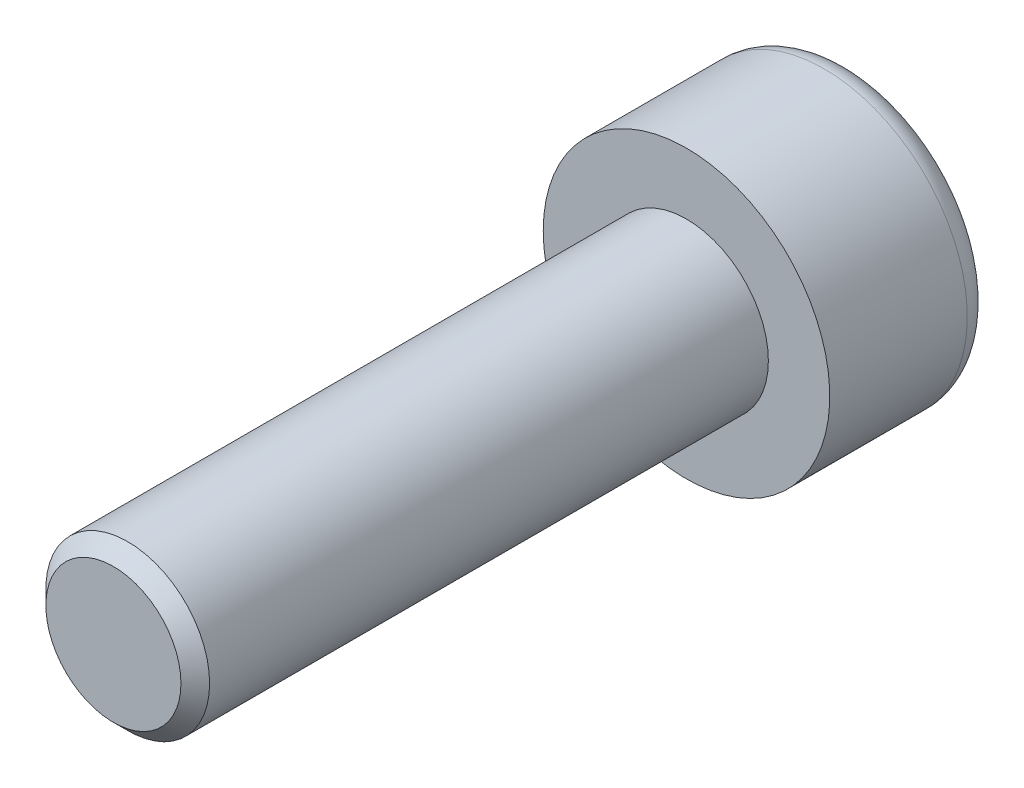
ISO-10303-21;
HEADER;
FILE_DESCRIPTION(('STEP AP214'),'2;1');
FILE_NAME('part.step','',(''),(''),'','','');
FILE_SCHEMA(('AUTOMOTIVE_DESIGN { 1 0 10303 214 1 1 1 1 }'));
ENDSEC;
DATA;
#1=APPLICATION_CONTEXT('core data for automotive mechanical design processes');
#2=APPLICATION_PROTOCOL_DEFINITION('international standard','automotive_design',2000,#1);
#3=PRODUCT_CONTEXT('',#1,'mechanical');
#4=PRODUCT('Part','Part','',(#3));
#5=PRODUCT_RELATED_PRODUCT_CATEGORY('part','',(#4));
#6=PRODUCT_DEFINITION_FORMATION('','',#4);
#7=PRODUCT_DEFINITION_CONTEXT('part definition',#1,'design');
#8=PRODUCT_DEFINITION('design','',#6,#7);
#9=PRODUCT_DEFINITION_SHAPE('','',#8);
#10=(LENGTH_UNIT() NAMED_UNIT(*) SI_UNIT(.MILLI.,.METRE.));
#11=(NAMED_UNIT(*) PLANE_ANGLE_UNIT() SI_UNIT($,.RADIAN.));
#12=(NAMED_UNIT(*) SI_UNIT($,.STERADIAN.) SOLID_ANGLE_UNIT());
#13=UNCERTAINTY_MEASURE_WITH_UNIT(LENGTH_MEASURE(1.E-05),#10,'distance_accuracy_value','');
#14=(GEOMETRIC_REPRESENTATION_CONTEXT(3) GLOBAL_UNCERTAINTY_ASSIGNED_CONTEXT((#13)) GLOBAL_UNIT_ASSIGNED_CONTEXT((#10,
#11,#12)) REPRESENTATION_CONTEXT('',''));
#15=CARTESIAN_POINT('',(0.,0.,0.));
#16=DIRECTION('',(0.,0.,1.));
#17=DIRECTION('',(1.,0.,0.));
#18=AXIS2_PLACEMENT_3D('',#15,#16,#17);
#19=CARTESIAN_POINT('',(0.,0.,-4.));
#20=DIRECTION('',(0.,0.,1.));
#21=DIRECTION('',(1.,0.,0.));
#22=AXIS2_PLACEMENT_3D('',#19,#20,#21);
#23=PLANE('',#22);
#24=CARTESIAN_POINT('',(0.,0.,-4.));
#25=DIRECTION('',(0.,0.,-1.));
#26=DIRECTION('',(-1.,0.,0.));
#27=AXIS2_PLACEMENT_3D('',#24,#25,#26);
#28=CIRCLE('',#27,2.86);
#29=CARTESIAN_POINT('',(-2.86,0.,-4.));
#30=VERTEX_POINT('',#29);
#31=EDGE_CURVE('E141',#30,#30,#28,.T.);
#32=ORIENTED_EDGE('',*,*,#31,.T.);
#33=EDGE_LOOP('',(#32));
#34=FACE_BOUND('',#33,.T.);
#35=DIRECTION('',(-0.86602540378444,0.499999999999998,0.));
#36=VECTOR('',#35,1.);
#37=CARTESIAN_POINT('',(0.,1.73205080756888,-4.));
#38=LINE('',#37,#36);
#39=CARTESIAN_POINT('',(1.5,0.866025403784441,-4.));
#40=VERTEX_POINT('',#39);
#41=CARTESIAN_POINT('',(0.,1.73205080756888,-4.));
#42=VERTEX_POINT('',#41);
#43=EDGE_CURVE('E45',#40,#42,#38,.T.);
#44=ORIENTED_EDGE('',*,*,#43,.T.);
#45=DIRECTION('',(-0.866025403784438,-0.500000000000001,0.));
#46=VECTOR('',#45,1.);
#47=CARTESIAN_POINT('',(0.,1.73205080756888,-4.));
#48=LINE('',#47,#46);
#49=CARTESIAN_POINT('',(-1.5,0.866025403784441,-4.));
#50=VERTEX_POINT('',#49);
#51=EDGE_CURVE('E85',#42,#50,#48,.T.);
#52=ORIENTED_EDGE('',*,*,#51,.T.);
#53=DIRECTION('',(0.,-1.,0.));
#54=VECTOR('',#53,1.);
#55=CARTESIAN_POINT('',(-1.5,-0.866025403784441,-4.));
#56=LINE('',#55,#54);
#57=CARTESIAN_POINT('',(-1.5,-0.866025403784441,-4.));
#58=VERTEX_POINT('',#57);
#59=EDGE_CURVE('E93',#50,#58,#56,.T.);
#60=ORIENTED_EDGE('',*,*,#59,.T.);
#61=DIRECTION('',(0.866025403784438,-0.500000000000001,0.));
#62=VECTOR('',#61,1.);
#63=CARTESIAN_POINT('',(0.,-1.73205080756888,-4.));
#64=LINE('',#63,#62);
#65=CARTESIAN_POINT('',(0.,-1.73205080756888,-4.));
#66=VERTEX_POINT('',#65);
#67=EDGE_CURVE('E111',#58,#66,#64,.T.);
#68=ORIENTED_EDGE('',*,*,#67,.T.);
#69=DIRECTION('',(0.86602540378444,0.499999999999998,0.));
#70=VECTOR('',#69,1.);
#71=CARTESIAN_POINT('',(0.,-1.73205080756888,-4.));
#72=LINE('',#71,#70);
#73=CARTESIAN_POINT('',(1.5,-0.866025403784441,-4.));
#74=VERTEX_POINT('',#73);
#75=EDGE_CURVE('E114',#66,#74,#72,.T.);
#76=ORIENTED_EDGE('',*,*,#75,.T.);
#77=DIRECTION('',(0.,1.,0.));
#78=VECTOR('',#77,1.);
#79=CARTESIAN_POINT('',(1.5,-0.866025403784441,-4.));
#80=LINE('',#79,#78);
#81=EDGE_CURVE('E104',#74,#40,#80,.T.);
#82=ORIENTED_EDGE('',*,*,#81,.T.);
#83=EDGE_LOOP('',(#44,#52,#60,#68,#76,#82));
#84=FACE_BOUND('',#83,.T.);
#85=ADVANCED_FACE('F31',(#34,#84),#23,.F.);
#86=CARTESIAN_POINT('',(0.,0.,-3.36));
#87=DIRECTION('',(0.,0.,-1.));
#88=DIRECTION('',(-1.,0.,0.));
#89=AXIS2_PLACEMENT_3D('',#86,#87,#88);
#90=TOROIDAL_SURFACE('',#89,2.86,0.64);
#91=ORIENTED_EDGE('',*,*,#31,.F.);
#92=EDGE_LOOP('',(#91));
#93=FACE_BOUND('',#92,.T.);
#94=CARTESIAN_POINT('',(0.,0.,-3.36));
#95=DIRECTION('',(0.,0.,-1.));
#96=DIRECTION('',(-1.,0.,0.));
#97=AXIS2_PLACEMENT_3D('',#94,#95,#96);
#98=CIRCLE('',#97,3.5);
#99=CARTESIAN_POINT('',(-3.5,0.,-3.36));
#100=VERTEX_POINT('',#99);
#101=EDGE_CURVE('E138',#100,#100,#98,.T.);
#102=ORIENTED_EDGE('',*,*,#101,.T.);
#103=EDGE_LOOP('',(#102));
#104=FACE_BOUND('',#103,.T.);
#105=ADVANCED_FACE('F160',(#93,#104),#90,.T.);
#106=CARTESIAN_POINT('',(0.,0.,0.));
#107=DIRECTION('',(0.,0.,-1.));
#108=DIRECTION('',(-1.,0.,0.));
#109=AXIS2_PLACEMENT_3D('',#106,#107,#108);
#110=CYLINDRICAL_SURFACE('',#109,3.5);
#111=ORIENTED_EDGE('',*,*,#101,.F.);
#112=EDGE_LOOP('',(#111));
#113=FACE_BOUND('',#112,.T.);
#114=CARTESIAN_POINT('',(0.,0.,0.));
#115=DIRECTION('',(0.,0.,-1.));
#116=DIRECTION('',(-1.,0.,0.));
#117=AXIS2_PLACEMENT_3D('',#114,#115,#116);
#118=CIRCLE('',#117,3.5);
#119=CARTESIAN_POINT('',(-3.5,0.,0.));
#120=VERTEX_POINT('',#119);
#121=EDGE_CURVE('E99',#120,#120,#118,.T.);
#122=ORIENTED_EDGE('',*,*,#121,.T.);
#123=EDGE_LOOP('',(#122));
#124=FACE_BOUND('',#123,.T.);
#125=ADVANCED_FACE('F165',(#113,#124),#110,.T.);
#126=CARTESIAN_POINT('',(0.,0.,0.));
#127=DIRECTION('',(0.,0.,-1.));
#128=DIRECTION('',(-1.,0.,0.));
#129=AXIS2_PLACEMENT_3D('',#126,#127,#128);
#130=PLANE('',#129);
#131=CARTESIAN_POINT('',(0.,0.,0.));
#132=DIRECTION('',(0.,0.,1.));
#133=DIRECTION('',(1.,0.,0.));
#134=AXIS2_PLACEMENT_3D('',#131,#132,#133);
#135=CIRCLE('',#134,2.);
#136=CARTESIAN_POINT('',(2.,0.,0.));
#137=VERTEX_POINT('',#136);
#138=EDGE_CURVE('E105',#137,#137,#135,.T.);
#139=ORIENTED_EDGE('',*,*,#138,.F.);
#140=EDGE_LOOP('',(#139));
#141=FACE_BOUND('',#140,.T.);
#142=ORIENTED_EDGE('',*,*,#121,.F.);
#143=EDGE_LOOP('',(#142));
#144=FACE_BOUND('',#143,.T.);
#145=ADVANCED_FACE('F173',(#141,#144),#130,.F.);
#146=CARTESIAN_POINT('',(0.,1.73205080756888,-2.));
#147=DIRECTION('',(-0.499999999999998,-0.86602540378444,0.));
#148=DIRECTION('',(0.86602540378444,-0.499999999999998,0.));
#149=AXIS2_PLACEMENT_3D('',#146,#147,#148);
#150=PLANE('',#149);
#151=ORIENTED_EDGE('',*,*,#43,.F.);
#152=DIRECTION('',(0.,0.,-1.));
#153=VECTOR('',#152,1.);
#154=CARTESIAN_POINT('',(1.5,0.866025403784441,-2.));
#155=LINE('',#154,#153);
#156=CARTESIAN_POINT('',(1.5,0.866025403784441,-2.));
#157=VERTEX_POINT('',#156);
#158=EDGE_CURVE('E127',#157,#40,#155,.T.);
#159=ORIENTED_EDGE('',*,*,#158,.F.);
#160=DIRECTION('',(-0.86602540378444,0.499999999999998,0.));
#161=VECTOR('',#160,1.);
#162=CARTESIAN_POINT('',(0.,1.73205080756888,-2.));
#163=LINE('',#162,#161);
#164=CARTESIAN_POINT('',(0.,1.73205080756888,-2.));
#165=VERTEX_POINT('',#164);
#166=EDGE_CURVE('E98',#157,#165,#163,.T.);
#167=ORIENTED_EDGE('',*,*,#166,.T.);
#168=DIRECTION('',(0.,0.,-1.));
#169=VECTOR('',#168,1.);
#170=CARTESIAN_POINT('',(0.,1.73205080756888,-2.));
#171=LINE('',#170,#169);
#172=EDGE_CURVE('E87',#165,#42,#171,.T.);
#173=ORIENTED_EDGE('',*,*,#172,.T.);
#174=EDGE_LOOP('',(#151,#159,#167,#173));
#175=FACE_BOUND('',#174,.T.);
#176=ADVANCED_FACE('F96',(#175),#150,.T.);
#177=CARTESIAN_POINT('',(0.,1.73205080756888,-2.));
#178=DIRECTION('',(0.500000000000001,-0.866025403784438,0.));
#179=DIRECTION('',(0.866025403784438,0.500000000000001,0.));
#180=AXIS2_PLACEMENT_3D('',#177,#178,#179);
#181=PLANE('',#180);
#182=ORIENTED_EDGE('',*,*,#51,.F.);
#183=ORIENTED_EDGE('',*,*,#172,.F.);
#184=DIRECTION('',(-0.866025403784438,-0.500000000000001,0.));
#185=VECTOR('',#184,1.);
#186=CARTESIAN_POINT('',(0.,1.73205080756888,-2.));
#187=LINE('',#186,#185);
#188=CARTESIAN_POINT('',(-1.5,0.866025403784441,-2.));
#189=VERTEX_POINT('',#188);
#190=EDGE_CURVE('E118',#165,#189,#187,.T.);
#191=ORIENTED_EDGE('',*,*,#190,.T.);
#192=DIRECTION('',(0.,0.,-1.));
#193=VECTOR('',#192,1.);
#194=CARTESIAN_POINT('',(-1.5,0.866025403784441,-2.));
#195=LINE('',#194,#193);
#196=EDGE_CURVE('E89',#189,#50,#195,.T.);
#197=ORIENTED_EDGE('',*,*,#196,.T.);
#198=EDGE_LOOP('',(#182,#183,#191,#197));
#199=FACE_BOUND('',#198,.T.);
#200=ADVANCED_FACE('F86',(#199),#181,.T.);
#201=CARTESIAN_POINT('',(-1.5,-0.866025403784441,-2.));
#202=DIRECTION('',(1.,0.,0.));
#203=DIRECTION('',(0.,0.,-1.));
#204=AXIS2_PLACEMENT_3D('',#201,#202,#203);
#205=PLANE('',#204);
#206=ORIENTED_EDGE('',*,*,#59,.F.);
#207=ORIENTED_EDGE('',*,*,#196,.F.);
#208=DIRECTION('',(0.,-1.,0.));
#209=VECTOR('',#208,1.);
#210=CARTESIAN_POINT('',(-1.5,-0.866025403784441,-2.));
#211=LINE('',#210,#209);
#212=CARTESIAN_POINT('',(-1.5,-0.866025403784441,-2.));
#213=VERTEX_POINT('',#212);
#214=EDGE_CURVE('E120',#189,#213,#211,.T.);
#215=ORIENTED_EDGE('',*,*,#214,.T.);
#216=DIRECTION('',(0.,0.,-1.));
#217=VECTOR('',#216,1.);
#218=CARTESIAN_POINT('',(-1.5,-0.866025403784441,-2.));
#219=LINE('',#218,#217);
#220=EDGE_CURVE('E133',#213,#58,#219,.T.);
#221=ORIENTED_EDGE('',*,*,#220,.T.);
#222=EDGE_LOOP('',(#206,#207,#215,#221));
#223=FACE_BOUND('',#222,.T.);
#224=ADVANCED_FACE('F188',(#223),#205,.T.);
#225=CARTESIAN_POINT('',(0.,-1.73205080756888,-2.));
#226=DIRECTION('',(0.500000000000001,0.866025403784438,0.));
#227=DIRECTION('',(-0.866025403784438,0.500000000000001,0.));
#228=AXIS2_PLACEMENT_3D('',#225,#226,#227);
#229=PLANE('',#228);
#230=ORIENTED_EDGE('',*,*,#67,.F.);
#231=ORIENTED_EDGE('',*,*,#220,.F.);
#232=DIRECTION('',(0.866025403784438,-0.500000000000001,0.));
#233=VECTOR('',#232,1.);
#234=CARTESIAN_POINT('',(0.,-1.73205080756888,-2.));
#235=LINE('',#234,#233);
#236=CARTESIAN_POINT('',(0.,-1.73205080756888,-2.));
#237=VERTEX_POINT('',#236);
#238=EDGE_CURVE('E122',#213,#237,#235,.T.);
#239=ORIENTED_EDGE('',*,*,#238,.T.);
#240=DIRECTION('',(0.,0.,-1.));
#241=VECTOR('',#240,1.);
#242=CARTESIAN_POINT('',(0.,-1.73205080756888,-2.));
#243=LINE('',#242,#241);
#244=EDGE_CURVE('E131',#237,#66,#243,.T.);
#245=ORIENTED_EDGE('',*,*,#244,.T.);
#246=EDGE_LOOP('',(#230,#231,#239,#245));
#247=FACE_BOUND('',#246,.T.);
#248=ADVANCED_FACE('F191',(#247),#229,.T.);
#249=CARTESIAN_POINT('',(0.,-1.73205080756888,-2.));
#250=DIRECTION('',(-0.499999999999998,0.86602540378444,0.));
#251=DIRECTION('',(-0.86602540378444,-0.499999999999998,0.));
#252=AXIS2_PLACEMENT_3D('',#249,#250,#251);
#253=PLANE('',#252);
#254=ORIENTED_EDGE('',*,*,#75,.F.);
#255=ORIENTED_EDGE('',*,*,#244,.F.);
#256=DIRECTION('',(0.86602540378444,0.499999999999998,0.));
#257=VECTOR('',#256,1.);
#258=CARTESIAN_POINT('',(0.,-1.73205080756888,-2.));
#259=LINE('',#258,#257);
#260=CARTESIAN_POINT('',(1.5,-0.866025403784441,-2.));
#261=VERTEX_POINT('',#260);
#262=EDGE_CURVE('E124',#237,#261,#259,.T.);
#263=ORIENTED_EDGE('',*,*,#262,.T.);
#264=DIRECTION('',(0.,0.,-1.));
#265=VECTOR('',#264,1.);
#266=CARTESIAN_POINT('',(1.5,-0.866025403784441,-2.));
#267=LINE('',#266,#265);
#268=EDGE_CURVE('E129',#261,#74,#267,.T.);
#269=ORIENTED_EDGE('',*,*,#268,.T.);
#270=EDGE_LOOP('',(#254,#255,#263,#269));
#271=FACE_BOUND('',#270,.T.);
#272=ADVANCED_FACE('F195',(#271),#253,.T.);
#273=CARTESIAN_POINT('',(1.5,-0.866025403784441,-2.));
#274=DIRECTION('',(-1.,0.,0.));
#275=DIRECTION('',(0.,0.,1.));
#276=AXIS2_PLACEMENT_3D('',#273,#274,#275);
#277=PLANE('',#276);
#278=ORIENTED_EDGE('',*,*,#81,.F.);
#279=ORIENTED_EDGE('',*,*,#268,.F.);
#280=DIRECTION('',(0.,1.,0.));
#281=VECTOR('',#280,1.);
#282=CARTESIAN_POINT('',(1.5,-0.866025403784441,-2.));
#283=LINE('',#282,#281);
#284=EDGE_CURVE('E52',#261,#157,#283,.T.);
#285=ORIENTED_EDGE('',*,*,#284,.T.);
#286=ORIENTED_EDGE('',*,*,#158,.T.);
#287=EDGE_LOOP('',(#278,#279,#285,#286));
#288=FACE_BOUND('',#287,.T.);
#289=ADVANCED_FACE('F199',(#288),#277,.T.);
#290=CARTESIAN_POINT('',(1.5,0.866025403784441,-2.));
#291=DIRECTION('',(0.,0.,1.));
#292=DIRECTION('',(1.,0.,0.));
#293=AXIS2_PLACEMENT_3D('',#290,#291,#292);
#294=PLANE('',#293);
#295=ORIENTED_EDGE('',*,*,#166,.F.);
#296=ORIENTED_EDGE('',*,*,#284,.F.);
#297=ORIENTED_EDGE('',*,*,#262,.F.);
#298=ORIENTED_EDGE('',*,*,#238,.F.);
#299=ORIENTED_EDGE('',*,*,#214,.F.);
#300=ORIENTED_EDGE('',*,*,#190,.F.);
#301=EDGE_LOOP('',(#295,#296,#297,#298,#299,#300));
#302=FACE_BOUND('',#301,.T.);
#303=ADVANCED_FACE('F203',(#302),#294,.F.);
#304=CARTESIAN_POINT('',(0.,0.,14.));
#305=DIRECTION('',(0.,0.,1.));
#306=DIRECTION('',(1.,0.,0.));
#307=AXIS2_PLACEMENT_3D('',#304,#305,#306);
#308=PLANE('',#307);
#309=CARTESIAN_POINT('',(0.,0.,14.));
#310=DIRECTION('',(0.,0.,1.));
#311=DIRECTION('',(1.,0.,0.));
#312=AXIS2_PLACEMENT_3D('',#309,#310,#311);
#313=CIRCLE('',#312,1.65);
#314=CARTESIAN_POINT('',(1.65,0.,14.));
#315=VERTEX_POINT('',#314);
#316=EDGE_CURVE('E38',#315,#315,#313,.T.);
#317=ORIENTED_EDGE('',*,*,#316,.T.);
#318=EDGE_LOOP('',(#317));
#319=FACE_BOUND('',#318,.T.);
#320=ADVANCED_FACE('F146',(#319),#308,.T.);
#321=CARTESIAN_POINT('',(0.,0.,0.));
#322=DIRECTION('',(0.,0.,1.));
#323=DIRECTION('',(1.,0.,0.));
#324=AXIS2_PLACEMENT_3D('',#321,#322,#323);
#325=CYLINDRICAL_SURFACE('',#324,2.);
#326=CARTESIAN_POINT('',(0.,0.,13.65));
#327=DIRECTION('',(0.,0.,1.));
#328=DIRECTION('',(1.,0.,0.));
#329=AXIS2_PLACEMENT_3D('',#326,#327,#328);
#330=CIRCLE('',#329,2.);
#331=CARTESIAN_POINT('',(2.,0.,13.65));
#332=VERTEX_POINT('',#331);
#333=EDGE_CURVE('E11',#332,#332,#330,.F.);
#334=ORIENTED_EDGE('',*,*,#333,.T.);
#335=EDGE_LOOP('',(#334));
#336=FACE_BOUND('',#335,.T.);
#337=ORIENTED_EDGE('',*,*,#138,.T.);
#338=EDGE_LOOP('',(#337));
#339=FACE_BOUND('',#338,.T.);
#340=ADVANCED_FACE('F150',(#336,#339),#325,.T.);
#341=CARTESIAN_POINT('',(0.,0.,14.));
#342=DIRECTION('',(0.,0.,-1.));
#343=DIRECTION('',(-1.,0.,0.));
#344=AXIS2_PLACEMENT_3D('',#341,#342,#343);
#345=CONICAL_SURFACE('',#344,1.65,0.785398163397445);
#346=ORIENTED_EDGE('',*,*,#333,.F.);
#347=EDGE_LOOP('',(#346));
#348=FACE_BOUND('',#347,.T.);
#349=ORIENTED_EDGE('',*,*,#316,.F.);
#350=EDGE_LOOP('',(#349));
#351=FACE_BOUND('',#350,.T.);
#352=ADVANCED_FACE('F148',(#348,#351),#345,.T.);
#353=CLOSED_SHELL('',(#85,#105,#125,#145,#176,#200,#224,#248,#272,#289,#303,#320,#340,#352));
#354=MANIFOLD_SOLID_BREP('B2',#353);
#355=ADVANCED_BREP_SHAPE_REPRESENTATION('',(#18,#354),#14);
#356=SHAPE_DEFINITION_REPRESENTATION(#9,#355);
ENDSEC;
END-ISO-10303-21;
